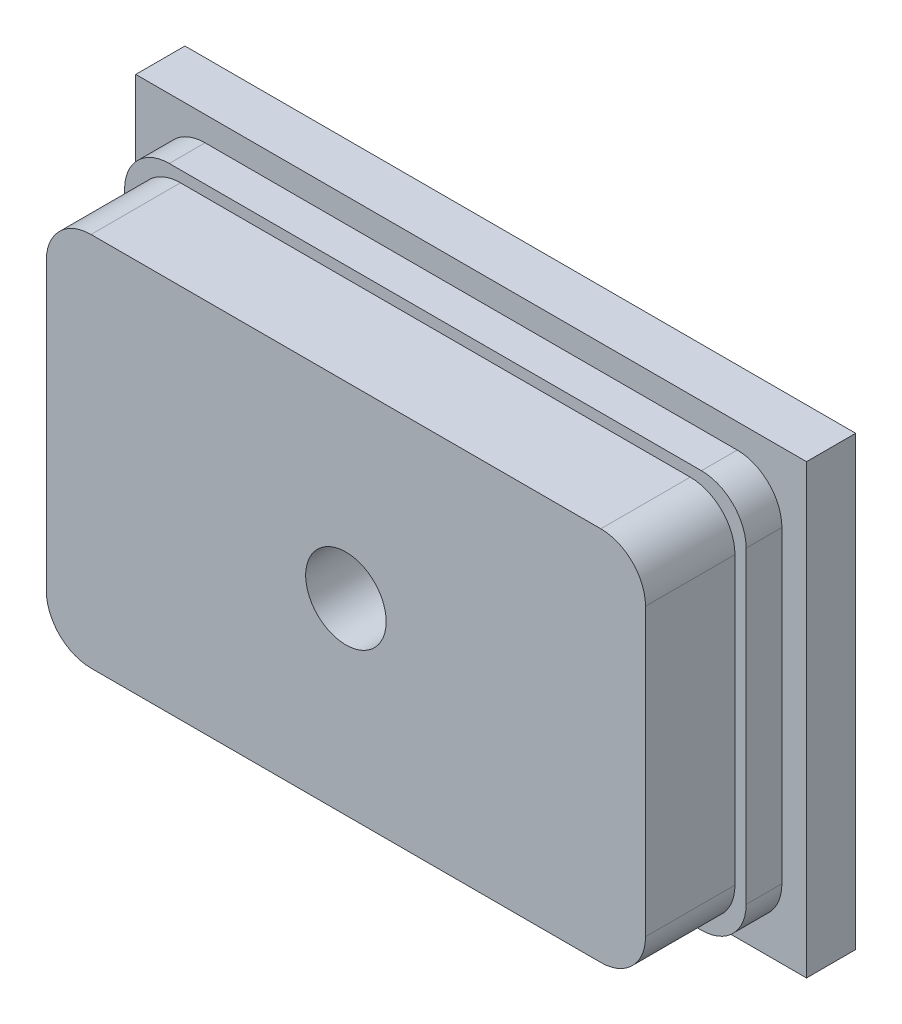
from build123d import *

# Parameters (mm, degrees)
ESQUISSE1_W             = 139
ESQUISSE1_H             = 89
EXTRUSION1_DEPTH        = 8
ESQUISSE2_W             = 134
ESQUISSE2_H             = 84
EXTRUSION2_DEPTH        = 20
CONG_1_R                = 10
CONG_2_R                = 10
ESQUISSE15_W            = 150
ESQUISSE15_H            = 100
EXTRUSION3_DEPTH        = 11
ESQUISSE3_R             = 9
ENL_V_MAT_EXTRU_1_DEPTH = 28


with BuildPart() as part:
    # Esquisse1 → Extrusion1 (new body)
    with BuildSketch(Plane.XY):
        Rectangle(ESQUISSE1_W, ESQUISSE1_H)
    extrude(amount=EXTRUSION1_DEPTH)

    # Esquisse2 → Extrusion2 (add)
    with BuildSketch(Plane.XY.offset(8)):
        Rectangle(ESQUISSE2_W, ESQUISSE2_H)
    extrude(amount=EXTRUSION2_DEPTH)

    # Cong_1
    cong_1_edges = [part.edges().sort_by_distance(p)[0] for p in [
        (-67, 42, 18),
        (-67, -42, 18),
        (67, -42, 18),
        (67, 42, 18),
    ]]
    fillet(cong_1_edges, radius=CONG_1_R)

    # Cong_2
    cong_2_edges = [part.edges().sort_by_distance(p)[0] for p in [
        (-69.5, 44.5, 4),
        (69.5, 44.5, 4),
        (69.5, -44.5, 4),
        (-69.5, -44.5, 4),
    ]]
    fillet(cong_2_edges, radius=CONG_2_R)

    # Esquisse15 → Extrusion3 (add)
    with BuildSketch(Plane(origin=(0, 0, 0), x_dir=(-1, 0, 0), z_dir=(0, 0, -1))):
        Rectangle(ESQUISSE15_W, ESQUISSE15_H)
    extrude(amount=EXTRUSION3_DEPTH)

    # Esquisse3 → Enl_v. mat.-Extru.1 (cut)
    with BuildSketch(Plane.XY.offset(28)):
        Circle(ESQUISSE3_R)
    extrude(amount=-ENL_V_MAT_EXTRU_1_DEPTH, mode=Mode.SUBTRACT)


solid = part.part
